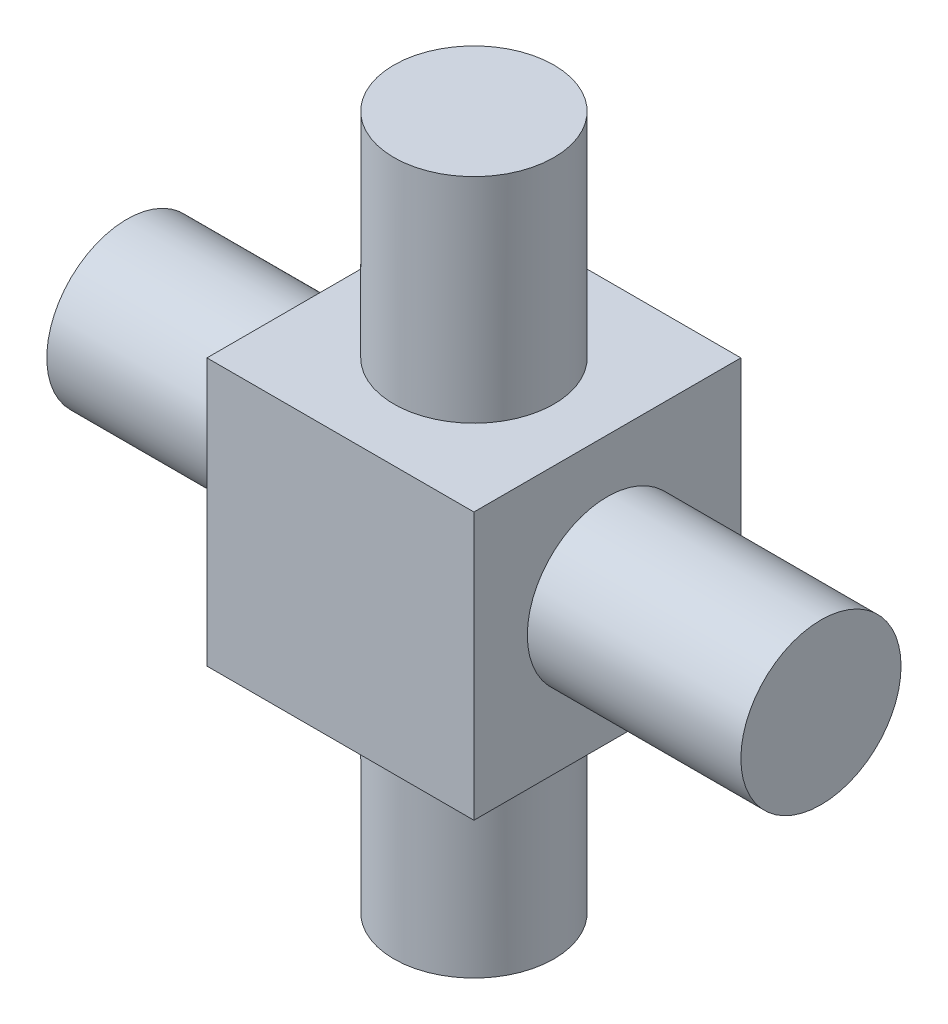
ISO-10303-21;
HEADER;
FILE_DESCRIPTION(('STEP AP214'),'2;1');
FILE_NAME('part.step','',(''),(''),'','','');
FILE_SCHEMA(('AUTOMOTIVE_DESIGN { 1 0 10303 214 1 1 1 1 }'));
ENDSEC;
DATA;
#1=APPLICATION_CONTEXT('core data for automotive mechanical design processes');
#2=APPLICATION_PROTOCOL_DEFINITION('international standard','automotive_design',2000,#1);
#3=PRODUCT_CONTEXT('',#1,'mechanical');
#4=PRODUCT('Part','Part','',(#3));
#5=PRODUCT_RELATED_PRODUCT_CATEGORY('part','',(#4));
#6=PRODUCT_DEFINITION_FORMATION('','',#4);
#7=PRODUCT_DEFINITION_CONTEXT('part definition',#1,'design');
#8=PRODUCT_DEFINITION('design','',#6,#7);
#9=PRODUCT_DEFINITION_SHAPE('','',#8);
#10=(LENGTH_UNIT() NAMED_UNIT(*) SI_UNIT(.MILLI.,.METRE.));
#11=(NAMED_UNIT(*) PLANE_ANGLE_UNIT() SI_UNIT($,.RADIAN.));
#12=(NAMED_UNIT(*) SI_UNIT($,.STERADIAN.) SOLID_ANGLE_UNIT());
#13=UNCERTAINTY_MEASURE_WITH_UNIT(LENGTH_MEASURE(1.E-05),#10,'distance_accuracy_value','');
#14=(GEOMETRIC_REPRESENTATION_CONTEXT(3) GLOBAL_UNCERTAINTY_ASSIGNED_CONTEXT((#13)) GLOBAL_UNIT_ASSIGNED_CONTEXT((#10,
#11,#12)) REPRESENTATION_CONTEXT('',''));
#15=CARTESIAN_POINT('',(0.,0.,0.));
#16=DIRECTION('',(0.,0.,1.));
#17=DIRECTION('',(1.,0.,0.));
#18=AXIS2_PLACEMENT_3D('',#15,#16,#17);
#19=CARTESIAN_POINT('',(25.,25.,25.));
#20=DIRECTION('',(-1.,0.,0.));
#21=DIRECTION('',(0.,0.,1.));
#22=AXIS2_PLACEMENT_3D('',#19,#20,#21);
#23=PLANE('',#22);
#24=CARTESIAN_POINT('',(25.,0.,0.));
#25=DIRECTION('',(-1.,0.,0.));
#26=DIRECTION('',(0.,0.,1.));
#27=AXIS2_PLACEMENT_3D('',#24,#25,#26);
#28=CIRCLE('',#27,15.);
#29=CARTESIAN_POINT('',(25.,0.,15.));
#30=VERTEX_POINT('',#29);
#31=EDGE_CURVE('E11',#30,#30,#28,.F.);
#32=ORIENTED_EDGE('',*,*,#31,.F.);
#33=EDGE_LOOP('',(#32));
#34=FACE_BOUND('',#33,.T.);
#35=DIRECTION('',(0.,0.,-1.));
#36=VECTOR('',#35,1.);
#37=CARTESIAN_POINT('',(25.,-25.,25.));
#38=LINE('',#37,#36);
#39=CARTESIAN_POINT('',(25.,-25.,25.));
#40=VERTEX_POINT('',#39);
#41=CARTESIAN_POINT('',(25.,-25.,-25.));
#42=VERTEX_POINT('',#41);
#43=EDGE_CURVE('E105',#40,#42,#38,.T.);
#44=ORIENTED_EDGE('',*,*,#43,.T.);
#45=DIRECTION('',(0.,-1.,0.));
#46=VECTOR('',#45,1.);
#47=CARTESIAN_POINT('',(25.,25.,-25.));
#48=LINE('',#47,#46);
#49=CARTESIAN_POINT('',(25.,25.,-25.));
#50=VERTEX_POINT('',#49);
#51=EDGE_CURVE('E96',#50,#42,#48,.T.);
#52=ORIENTED_EDGE('',*,*,#51,.F.);
#53=DIRECTION('',(0.,0.,-1.));
#54=VECTOR('',#53,1.);
#55=CARTESIAN_POINT('',(25.,25.,25.));
#56=LINE('',#55,#54);
#57=CARTESIAN_POINT('',(25.,25.,25.));
#58=VERTEX_POINT('',#57);
#59=EDGE_CURVE('E90',#58,#50,#56,.T.);
#60=ORIENTED_EDGE('',*,*,#59,.F.);
#61=DIRECTION('',(0.,-1.,0.));
#62=VECTOR('',#61,1.);
#63=CARTESIAN_POINT('',(25.,25.,25.));
#64=LINE('',#63,#62);
#65=EDGE_CURVE('E101',#58,#40,#64,.T.);
#66=ORIENTED_EDGE('',*,*,#65,.T.);
#67=EDGE_LOOP('',(#44,#52,#60,#66));
#68=FACE_BOUND('',#67,.T.);
#69=ADVANCED_FACE('F37',(#34,#68),#23,.F.);
#70=CARTESIAN_POINT('',(-25.,25.,-25.));
#71=DIRECTION('',(0.,0.,1.));
#72=DIRECTION('',(1.,0.,0.));
#73=AXIS2_PLACEMENT_3D('',#70,#71,#72);
#74=PLANE('',#73);
#75=DIRECTION('',(-1.,0.,0.));
#76=VECTOR('',#75,1.);
#77=CARTESIAN_POINT('',(-25.,-25.,-25.));
#78=LINE('',#77,#76);
#79=CARTESIAN_POINT('',(-25.,-25.,-25.));
#80=VERTEX_POINT('',#79);
#81=EDGE_CURVE('E95',#42,#80,#78,.T.);
#82=ORIENTED_EDGE('',*,*,#81,.T.);
#83=DIRECTION('',(0.,-1.,0.));
#84=VECTOR('',#83,1.);
#85=CARTESIAN_POINT('',(-25.,25.,-25.));
#86=LINE('',#85,#84);
#87=CARTESIAN_POINT('',(-25.,25.,-25.));
#88=VERTEX_POINT('',#87);
#89=EDGE_CURVE('E93',#88,#80,#86,.T.);
#90=ORIENTED_EDGE('',*,*,#89,.F.);
#91=DIRECTION('',(-1.,0.,0.));
#92=VECTOR('',#91,1.);
#93=CARTESIAN_POINT('',(-25.,25.,-25.));
#94=LINE('',#93,#92);
#95=EDGE_CURVE('E85',#50,#88,#94,.T.);
#96=ORIENTED_EDGE('',*,*,#95,.F.);
#97=ORIENTED_EDGE('',*,*,#51,.T.);
#98=EDGE_LOOP('',(#82,#90,#96,#97));
#99=FACE_BOUND('',#98,.T.);
#100=ADVANCED_FACE('F94',(#99),#74,.F.);
#101=CARTESIAN_POINT('',(-25.,25.,25.));
#102=DIRECTION('',(1.,0.,0.));
#103=DIRECTION('',(0.,0.,-1.));
#104=AXIS2_PLACEMENT_3D('',#101,#102,#103);
#105=PLANE('',#104);
#106=CARTESIAN_POINT('',(-25.,0.,0.));
#107=DIRECTION('',(1.,0.,0.));
#108=DIRECTION('',(0.,0.,-1.));
#109=AXIS2_PLACEMENT_3D('',#106,#107,#108);
#110=CIRCLE('',#109,15.);
#111=CARTESIAN_POINT('',(-25.,0.,-15.));
#112=VERTEX_POINT('',#111);
#113=EDGE_CURVE('E40',#112,#112,#110,.F.);
#114=ORIENTED_EDGE('',*,*,#113,.F.);
#115=EDGE_LOOP('',(#114));
#116=FACE_BOUND('',#115,.T.);
#117=DIRECTION('',(0.,0.,1.));
#118=VECTOR('',#117,1.);
#119=CARTESIAN_POINT('',(-25.,-25.,25.));
#120=LINE('',#119,#118);
#121=CARTESIAN_POINT('',(-25.,-25.,25.));
#122=VERTEX_POINT('',#121);
#123=EDGE_CURVE('E71',#80,#122,#120,.T.);
#124=ORIENTED_EDGE('',*,*,#123,.T.);
#125=DIRECTION('',(0.,-1.,0.));
#126=VECTOR('',#125,1.);
#127=CARTESIAN_POINT('',(-25.,25.,25.));
#128=LINE('',#127,#126);
#129=CARTESIAN_POINT('',(-25.,25.,25.));
#130=VERTEX_POINT('',#129);
#131=EDGE_CURVE('E97',#130,#122,#128,.T.);
#132=ORIENTED_EDGE('',*,*,#131,.F.);
#133=DIRECTION('',(0.,0.,1.));
#134=VECTOR('',#133,1.);
#135=CARTESIAN_POINT('',(-25.,25.,25.));
#136=LINE('',#135,#134);
#137=EDGE_CURVE('E88',#88,#130,#136,.T.);
#138=ORIENTED_EDGE('',*,*,#137,.F.);
#139=ORIENTED_EDGE('',*,*,#89,.T.);
#140=EDGE_LOOP('',(#124,#132,#138,#139));
#141=FACE_BOUND('',#140,.T.);
#142=ADVANCED_FACE('F99',(#116,#141),#105,.F.);
#143=CARTESIAN_POINT('',(-25.,25.,25.));
#144=DIRECTION('',(0.,0.,-1.));
#145=DIRECTION('',(-1.,0.,0.));
#146=AXIS2_PLACEMENT_3D('',#143,#144,#145);
#147=PLANE('',#146);
#148=DIRECTION('',(1.,0.,0.));
#149=VECTOR('',#148,1.);
#150=CARTESIAN_POINT('',(-25.,-25.,25.));
#151=LINE('',#150,#149);
#152=EDGE_CURVE('E77',#122,#40,#151,.T.);
#153=ORIENTED_EDGE('',*,*,#152,.T.);
#154=ORIENTED_EDGE('',*,*,#65,.F.);
#155=DIRECTION('',(1.,0.,0.));
#156=VECTOR('',#155,1.);
#157=CARTESIAN_POINT('',(-25.,25.,25.));
#158=LINE('',#157,#156);
#159=EDGE_CURVE('E54',#130,#58,#158,.T.);
#160=ORIENTED_EDGE('',*,*,#159,.F.);
#161=ORIENTED_EDGE('',*,*,#131,.T.);
#162=EDGE_LOOP('',(#153,#154,#160,#161));
#163=FACE_BOUND('',#162,.T.);
#164=ADVANCED_FACE('F138',(#163),#147,.F.);
#165=CARTESIAN_POINT('',(0.,25.,0.));
#166=DIRECTION('',(0.,-1.,0.));
#167=DIRECTION('',(0.,0.,-1.));
#168=AXIS2_PLACEMENT_3D('',#165,#166,#167);
#169=PLANE('',#168);
#170=CARTESIAN_POINT('',(0.,25.,0.));
#171=DIRECTION('',(0.,-1.,0.));
#172=DIRECTION('',(0.,0.,-1.));
#173=AXIS2_PLACEMENT_3D('',#170,#171,#172);
#174=CIRCLE('',#173,15.);
#175=CARTESIAN_POINT('',(0.,25.,-15.));
#176=VERTEX_POINT('',#175);
#177=EDGE_CURVE('E114',#176,#176,#174,.F.);
#178=ORIENTED_EDGE('',*,*,#177,.F.);
#179=EDGE_LOOP('',(#178));
#180=FACE_BOUND('',#179,.T.);
#181=ORIENTED_EDGE('',*,*,#59,.T.);
#182=ORIENTED_EDGE('',*,*,#95,.T.);
#183=ORIENTED_EDGE('',*,*,#137,.T.);
#184=ORIENTED_EDGE('',*,*,#159,.T.);
#185=EDGE_LOOP('',(#181,#182,#183,#184));
#186=FACE_BOUND('',#185,.T.);
#187=ADVANCED_FACE('F86',(#180,#186),#169,.F.);
#188=CARTESIAN_POINT('',(0.,-25.,0.));
#189=DIRECTION('',(0.,-1.,0.));
#190=DIRECTION('',(0.,0.,-1.));
#191=AXIS2_PLACEMENT_3D('',#188,#189,#190);
#192=PLANE('',#191);
#193=CARTESIAN_POINT('',(0.,-25.,0.));
#194=DIRECTION('',(0.,-1.,0.));
#195=DIRECTION('',(0.,0.,-1.));
#196=AXIS2_PLACEMENT_3D('',#193,#194,#195);
#197=CIRCLE('',#196,15.);
#198=CARTESIAN_POINT('',(0.,-25.,-15.));
#199=VERTEX_POINT('',#198);
#200=EDGE_CURVE('E108',#199,#199,#197,.F.);
#201=ORIENTED_EDGE('',*,*,#200,.T.);
#202=EDGE_LOOP('',(#201));
#203=FACE_BOUND('',#202,.T.);
#204=ORIENTED_EDGE('',*,*,#43,.F.);
#205=ORIENTED_EDGE('',*,*,#152,.F.);
#206=ORIENTED_EDGE('',*,*,#123,.F.);
#207=ORIENTED_EDGE('',*,*,#81,.F.);
#208=EDGE_LOOP('',(#204,#205,#206,#207));
#209=FACE_BOUND('',#208,.T.);
#210=ADVANCED_FACE('F153',(#203,#209),#192,.T.);
#211=CARTESIAN_POINT('',(0.,-65.,0.));
#212=DIRECTION('',(0.,1.,0.));
#213=DIRECTION('',(0.,0.,1.));
#214=AXIS2_PLACEMENT_3D('',#211,#212,#213);
#215=PLANE('',#214);
#216=CARTESIAN_POINT('',(0.,-65.,0.));
#217=DIRECTION('',(0.,1.,0.));
#218=DIRECTION('',(0.,0.,1.));
#219=AXIS2_PLACEMENT_3D('',#216,#217,#218);
#220=CIRCLE('',#219,15.);
#221=CARTESIAN_POINT('',(0.,-65.,15.));
#222=VERTEX_POINT('',#221);
#223=EDGE_CURVE('E120',#222,#222,#220,.T.);
#224=ORIENTED_EDGE('',*,*,#223,.F.);
#225=EDGE_LOOP('',(#224));
#226=FACE_BOUND('',#225,.T.);
#227=ADVANCED_FACE('F155',(#226),#215,.F.);
#228=CARTESIAN_POINT('',(0.,65.,0.));
#229=DIRECTION('',(0.,-1.,0.));
#230=DIRECTION('',(0.,0.,-1.));
#231=AXIS2_PLACEMENT_3D('',#228,#229,#230);
#232=CYLINDRICAL_SURFACE('',#231,15.);
#233=ORIENTED_EDGE('',*,*,#200,.F.);
#234=EDGE_LOOP('',(#233));
#235=FACE_BOUND('',#234,.T.);
#236=ORIENTED_EDGE('',*,*,#223,.T.);
#237=EDGE_LOOP('',(#236));
#238=FACE_BOUND('',#237,.T.);
#239=ADVANCED_FACE('F161',(#235,#238),#232,.T.);
#240=CARTESIAN_POINT('',(0.,65.,0.));
#241=DIRECTION('',(0.,1.,0.));
#242=DIRECTION('',(0.,0.,1.));
#243=AXIS2_PLACEMENT_3D('',#240,#241,#242);
#244=CIRCLE('',#243,15.);
#245=CARTESIAN_POINT('',(0.,65.,15.));
#246=VERTEX_POINT('',#245);
#247=EDGE_CURVE('E116',#246,#246,#244,.T.);
#248=ORIENTED_EDGE('',*,*,#247,.F.);
#249=EDGE_LOOP('',(#248));
#250=FACE_BOUND('',#249,.T.);
#251=ORIENTED_EDGE('',*,*,#177,.T.);
#252=EDGE_LOOP('',(#251));
#253=FACE_BOUND('',#252,.T.);
#254=ADVANCED_FACE('F168',(#250,#253),#232,.T.);
#255=CARTESIAN_POINT('',(0.,65.,0.));
#256=DIRECTION('',(0.,1.,0.));
#257=DIRECTION('',(0.,0.,1.));
#258=AXIS2_PLACEMENT_3D('',#255,#256,#257);
#259=PLANE('',#258);
#260=ORIENTED_EDGE('',*,*,#247,.T.);
#261=EDGE_LOOP('',(#260));
#262=FACE_BOUND('',#261,.T.);
#263=ADVANCED_FACE('F171',(#262),#259,.T.);
#264=CARTESIAN_POINT('',(-65.,0.,0.));
#265=DIRECTION('',(1.,0.,0.));
#266=DIRECTION('',(0.,0.,-1.));
#267=AXIS2_PLACEMENT_3D('',#264,#265,#266);
#268=PLANE('',#267);
#269=CARTESIAN_POINT('',(-65.,0.,0.));
#270=DIRECTION('',(1.,0.,0.));
#271=DIRECTION('',(0.,0.,-1.));
#272=AXIS2_PLACEMENT_3D('',#269,#270,#271);
#273=CIRCLE('',#272,15.);
#274=CARTESIAN_POINT('',(-65.,0.,-15.));
#275=VERTEX_POINT('',#274);
#276=EDGE_CURVE('E189',#275,#275,#273,.T.);
#277=ORIENTED_EDGE('',*,*,#276,.F.);
#278=EDGE_LOOP('',(#277));
#279=FACE_BOUND('',#278,.T.);
#280=ADVANCED_FACE('F174',(#279),#268,.F.);
#281=CARTESIAN_POINT('',(65.,0.,0.));
#282=DIRECTION('',(-1.,0.,0.));
#283=DIRECTION('',(0.,0.,1.));
#284=AXIS2_PLACEMENT_3D('',#281,#282,#283);
#285=CYLINDRICAL_SURFACE('',#284,15.);
#286=ORIENTED_EDGE('',*,*,#276,.T.);
#287=EDGE_LOOP('',(#286));
#288=FACE_BOUND('',#287,.T.);
#289=ORIENTED_EDGE('',*,*,#113,.T.);
#290=EDGE_LOOP('',(#289));
#291=FACE_BOUND('',#290,.T.);
#292=ADVANCED_FACE('F135',(#288,#291),#285,.T.);
#293=CARTESIAN_POINT('',(65.,0.,0.));
#294=DIRECTION('',(1.,0.,0.));
#295=DIRECTION('',(0.,0.,-1.));
#296=AXIS2_PLACEMENT_3D('',#293,#294,#295);
#297=CIRCLE('',#296,15.);
#298=CARTESIAN_POINT('',(65.,0.,-15.));
#299=VERTEX_POINT('',#298);
#300=EDGE_CURVE('E125',#299,#299,#297,.T.);
#301=ORIENTED_EDGE('',*,*,#300,.F.);
#302=EDGE_LOOP('',(#301));
#303=FACE_BOUND('',#302,.T.);
#304=ORIENTED_EDGE('',*,*,#31,.T.);
#305=EDGE_LOOP('',(#304));
#306=FACE_BOUND('',#305,.T.);
#307=ADVANCED_FACE('F175',(#303,#306),#285,.T.);
#308=CARTESIAN_POINT('',(65.,0.,0.));
#309=DIRECTION('',(1.,0.,0.));
#310=DIRECTION('',(0.,0.,-1.));
#311=AXIS2_PLACEMENT_3D('',#308,#309,#310);
#312=PLANE('',#311);
#313=ORIENTED_EDGE('',*,*,#300,.T.);
#314=EDGE_LOOP('',(#313));
#315=FACE_BOUND('',#314,.T.);
#316=ADVANCED_FACE('F178',(#315),#312,.T.);
#317=CLOSED_SHELL('',(#69,#100,#142,#164,#187,#210,#227,#239,#254,#263,#280,#292,#307,#316));
#318=MANIFOLD_SOLID_BREP('B2',#317);
#319=ADVANCED_BREP_SHAPE_REPRESENTATION('',(#18,#318),#14);
#320=SHAPE_DEFINITION_REPRESENTATION(#9,#319);
ENDSEC;
END-ISO-10303-21;
